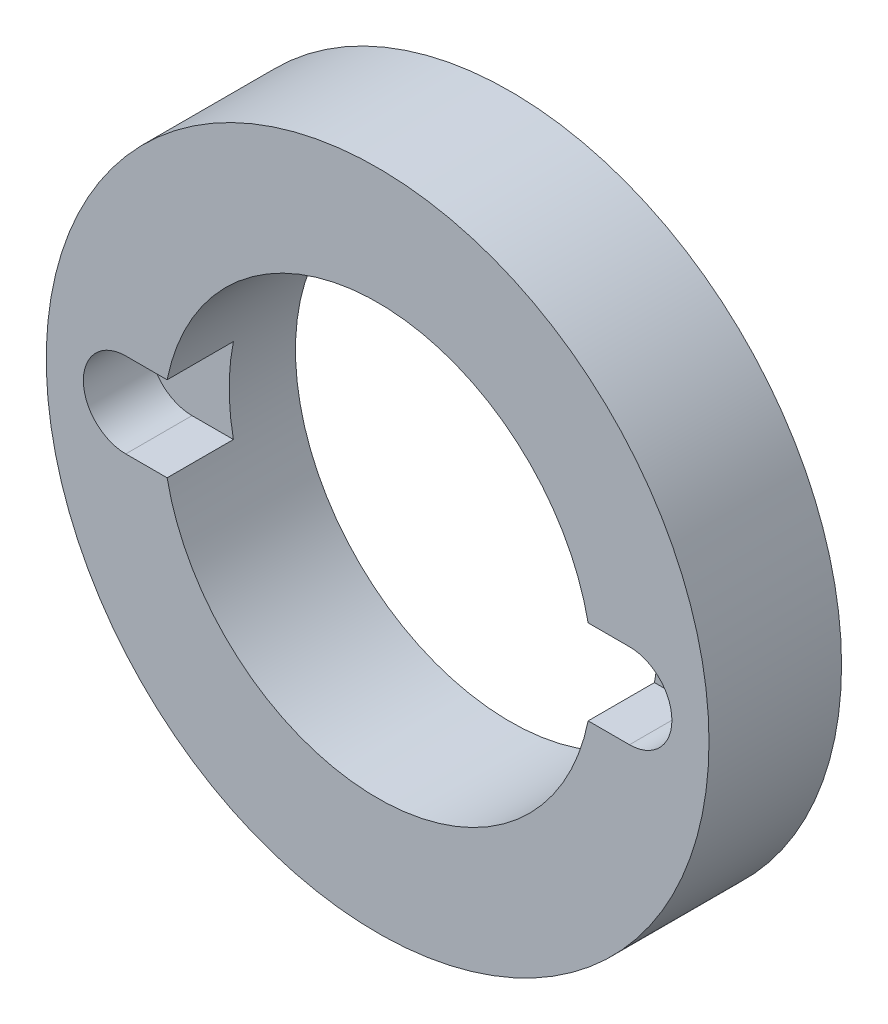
ISO-10303-21;
HEADER;
FILE_DESCRIPTION(('STEP AP214'),'2;1');
FILE_NAME('part.step','',(''),(''),'','','');
FILE_SCHEMA(('AUTOMOTIVE_DESIGN { 1 0 10303 214 1 1 1 1 }'));
ENDSEC;
DATA;
#1=APPLICATION_CONTEXT('core data for automotive mechanical design processes');
#2=APPLICATION_PROTOCOL_DEFINITION('international standard','automotive_design',2000,#1);
#3=PRODUCT_CONTEXT('',#1,'mechanical');
#4=PRODUCT('Part','Part','',(#3));
#5=PRODUCT_RELATED_PRODUCT_CATEGORY('part','',(#4));
#6=PRODUCT_DEFINITION_FORMATION('','',#4);
#7=PRODUCT_DEFINITION_CONTEXT('part definition',#1,'design');
#8=PRODUCT_DEFINITION('design','',#6,#7);
#9=PRODUCT_DEFINITION_SHAPE('','',#8);
#10=(LENGTH_UNIT() NAMED_UNIT(*) SI_UNIT(.MILLI.,.METRE.));
#11=(NAMED_UNIT(*) PLANE_ANGLE_UNIT() SI_UNIT($,.RADIAN.));
#12=(NAMED_UNIT(*) SI_UNIT($,.STERADIAN.) SOLID_ANGLE_UNIT());
#13=UNCERTAINTY_MEASURE_WITH_UNIT(LENGTH_MEASURE(1.E-05),#10,'distance_accuracy_value','');
#14=(GEOMETRIC_REPRESENTATION_CONTEXT(3) GLOBAL_UNCERTAINTY_ASSIGNED_CONTEXT((#13)) GLOBAL_UNIT_ASSIGNED_CONTEXT((#10,
#11,#12)) REPRESENTATION_CONTEXT('',''));
#15=CARTESIAN_POINT('',(0.,0.,0.));
#16=DIRECTION('',(0.,0.,1.));
#17=DIRECTION('',(1.,0.,0.));
#18=AXIS2_PLACEMENT_3D('',#15,#16,#17);
#19=CARTESIAN_POINT('',(0.,0.,5.));
#20=DIRECTION('',(0.,0.,-1.));
#21=DIRECTION('',(-1.,0.,0.));
#22=AXIS2_PLACEMENT_3D('',#19,#20,#21);
#23=CYLINDRICAL_SURFACE('',#22,12.5);
#24=CARTESIAN_POINT('',(0.,0.,5.));
#25=DIRECTION('',(0.,0.,1.));
#26=DIRECTION('',(1.,0.,0.));
#27=AXIS2_PLACEMENT_3D('',#24,#25,#26);
#28=CIRCLE('',#27,12.5);
#29=CARTESIAN_POINT('',(12.5,0.,5.));
#30=VERTEX_POINT('',#29);
#31=EDGE_CURVE('E156',#30,#30,#28,.T.);
#32=ORIENTED_EDGE('',*,*,#31,.F.);
#33=EDGE_LOOP('',(#32));
#34=FACE_BOUND('',#33,.T.);
#35=CARTESIAN_POINT('',(0.,0.,0.));
#36=DIRECTION('',(0.,0.,1.));
#37=DIRECTION('',(1.,0.,0.));
#38=AXIS2_PLACEMENT_3D('',#35,#36,#37);
#39=CIRCLE('',#38,12.5);
#40=CARTESIAN_POINT('',(12.5,0.,0.));
#41=VERTEX_POINT('',#40);
#42=EDGE_CURVE('E153',#41,#41,#39,.T.);
#43=ORIENTED_EDGE('',*,*,#42,.T.);
#44=EDGE_LOOP('',(#43));
#45=FACE_BOUND('',#44,.T.);
#46=ADVANCED_FACE('F36',(#34,#45),#23,.T.);
#47=CARTESIAN_POINT('',(0.,0.,5.));
#48=DIRECTION('',(0.,0.,1.));
#49=DIRECTION('',(1.,0.,0.));
#50=AXIS2_PLACEMENT_3D('',#47,#48,#49);
#51=PLANE('',#50);
#52=DIRECTION('',(-1.,0.,0.));
#53=VECTOR('',#52,1.);
#54=CARTESIAN_POINT('',(-9.50000000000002,1.6,5.));
#55=LINE('',#54,#53);
#56=CARTESIAN_POINT('',(-7.94040301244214,1.6,5.));
#57=VERTEX_POINT('',#56);
#58=CARTESIAN_POINT('',(-9.50000000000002,1.6,5.));
#59=VERTEX_POINT('',#58);
#60=EDGE_CURVE('E129',#57,#59,#55,.T.);
#61=ORIENTED_EDGE('',*,*,#60,.F.);
#62=CARTESIAN_POINT('',(0.,0.,5.));
#63=DIRECTION('',(0.,0.,1.));
#64=DIRECTION('',(1.,0.,0.));
#65=AXIS2_PLACEMENT_3D('',#62,#63,#64);
#66=CIRCLE('',#65,8.1);
#67=CARTESIAN_POINT('',(7.94040301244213,1.6,5.));
#68=VERTEX_POINT('',#67);
#69=EDGE_CURVE('E147',#68,#57,#66,.T.);
#70=ORIENTED_EDGE('',*,*,#69,.F.);
#71=CARTESIAN_POINT('',(9.50000000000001,1.6,5.));
#72=VERTEX_POINT('',#71);
#73=EDGE_CURVE('E132',#72,#68,#55,.T.);
#74=ORIENTED_EDGE('',*,*,#73,.F.);
#75=CARTESIAN_POINT('',(9.50000000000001,0.,5.));
#76=DIRECTION('',(0.,0.,1.));
#77=DIRECTION('',(1.,0.,0.));
#78=AXIS2_PLACEMENT_3D('',#75,#76,#77);
#79=CIRCLE('',#78,1.6);
#80=CARTESIAN_POINT('',(9.5,-1.6,5.));
#81=VERTEX_POINT('',#80);
#82=EDGE_CURVE('E126',#81,#72,#79,.T.);
#83=ORIENTED_EDGE('',*,*,#82,.F.);
#84=DIRECTION('',(1.,0.,0.));
#85=VECTOR('',#84,1.);
#86=CARTESIAN_POINT('',(9.5,-1.6,5.));
#87=LINE('',#86,#85);
#88=CARTESIAN_POINT('',(7.94040301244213,-1.60000000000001,5.));
#89=VERTEX_POINT('',#88);
#90=EDGE_CURVE('E118',#89,#81,#87,.T.);
#91=ORIENTED_EDGE('',*,*,#90,.F.);
#92=CARTESIAN_POINT('',(-7.94040301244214,-1.6,5.));
#93=VERTEX_POINT('',#92);
#94=EDGE_CURVE('E125',#93,#89,#66,.T.);
#95=ORIENTED_EDGE('',*,*,#94,.F.);
#96=CARTESIAN_POINT('',(-9.50000000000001,-1.6,5.));
#97=VERTEX_POINT('',#96);
#98=EDGE_CURVE('E104',#97,#93,#87,.T.);
#99=ORIENTED_EDGE('',*,*,#98,.F.);
#100=CARTESIAN_POINT('',(-9.50000000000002,0.,5.));
#101=DIRECTION('',(0.,0.,1.));
#102=DIRECTION('',(-1.,0.,0.));
#103=AXIS2_PLACEMENT_3D('',#100,#101,#102);
#104=CIRCLE('',#103,1.6);
#105=EDGE_CURVE('E112',#59,#97,#104,.T.);
#106=ORIENTED_EDGE('',*,*,#105,.F.);
#107=EDGE_LOOP('',(#61,#70,#74,#83,#91,#95,#99,#106));
#108=FACE_BOUND('',#107,.T.);
#109=ORIENTED_EDGE('',*,*,#31,.T.);
#110=EDGE_LOOP('',(#109));
#111=FACE_BOUND('',#110,.T.);
#112=ADVANCED_FACE('F121',(#108,#111),#51,.T.);
#113=CARTESIAN_POINT('',(0.,0.,0.));
#114=DIRECTION('',(0.,0.,1.));
#115=DIRECTION('',(1.,0.,0.));
#116=AXIS2_PLACEMENT_3D('',#113,#114,#115);
#117=PLANE('',#116);
#118=CARTESIAN_POINT('',(0.,0.,0.));
#119=DIRECTION('',(0.,0.,1.));
#120=DIRECTION('',(1.,0.,0.));
#121=AXIS2_PLACEMENT_3D('',#118,#119,#120);
#122=CIRCLE('',#121,8.1);
#123=CARTESIAN_POINT('',(8.10000000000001,0.,0.));
#124=VERTEX_POINT('',#123);
#125=EDGE_CURVE('E150',#124,#124,#122,.T.);
#126=ORIENTED_EDGE('',*,*,#125,.T.);
#127=EDGE_LOOP('',(#126));
#128=FACE_BOUND('',#127,.T.);
#129=ORIENTED_EDGE('',*,*,#42,.F.);
#130=EDGE_LOOP('',(#129));
#131=FACE_BOUND('',#130,.T.);
#132=ADVANCED_FACE('F196',(#128,#131),#117,.F.);
#133=CARTESIAN_POINT('',(0.,0.,0.));
#134=DIRECTION('',(0.,0.,1.));
#135=DIRECTION('',(1.,0.,0.));
#136=AXIS2_PLACEMENT_3D('',#133,#134,#135);
#137=CYLINDRICAL_SURFACE('',#136,8.1);
#138=CARTESIAN_POINT('',(0.,0.,2.5));
#139=DIRECTION('',(0.,0.,-1.));
#140=DIRECTION('',(-1.,0.,0.));
#141=AXIS2_PLACEMENT_3D('',#138,#139,#140);
#142=CIRCLE('',#141,8.1);
#143=CARTESIAN_POINT('',(7.94040301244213,-1.6,2.5));
#144=VERTEX_POINT('',#143);
#145=CARTESIAN_POINT('',(7.94040301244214,1.6,2.5));
#146=VERTEX_POINT('',#145);
#147=EDGE_CURVE('E163',#144,#146,#142,.F.);
#148=ORIENTED_EDGE('',*,*,#147,.T.);
#149=DIRECTION('',(0.,0.,1.));
#150=VECTOR('',#149,1.);
#151=CARTESIAN_POINT('',(7.94040301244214,1.6,0.));
#152=LINE('',#151,#150);
#153=EDGE_CURVE('E11',#146,#68,#152,.T.);
#154=ORIENTED_EDGE('',*,*,#153,.T.);
#155=ORIENTED_EDGE('',*,*,#69,.T.);
#156=DIRECTION('',(0.,0.,1.));
#157=VECTOR('',#156,1.);
#158=CARTESIAN_POINT('',(-7.94040301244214,1.60000000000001,0.));
#159=LINE('',#158,#157);
#160=CARTESIAN_POINT('',(-7.94040301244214,1.60000000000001,2.5));
#161=VERTEX_POINT('',#160);
#162=EDGE_CURVE('E165',#57,#161,#159,.F.);
#163=ORIENTED_EDGE('',*,*,#162,.T.);
#164=CARTESIAN_POINT('',(-7.94040301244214,-1.6,2.5));
#165=VERTEX_POINT('',#164);
#166=EDGE_CURVE('E159',#161,#165,#142,.F.);
#167=ORIENTED_EDGE('',*,*,#166,.T.);
#168=DIRECTION('',(0.,0.,1.));
#169=VECTOR('',#168,1.);
#170=CARTESIAN_POINT('',(-7.94040301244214,-1.6,0.));
#171=LINE('',#170,#169);
#172=EDGE_CURVE('E162',#165,#93,#171,.T.);
#173=ORIENTED_EDGE('',*,*,#172,.T.);
#174=ORIENTED_EDGE('',*,*,#94,.T.);
#175=DIRECTION('',(0.,0.,1.));
#176=VECTOR('',#175,1.);
#177=CARTESIAN_POINT('',(7.94040301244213,-1.6,0.));
#178=LINE('',#177,#176);
#179=EDGE_CURVE('E43',#89,#144,#178,.F.);
#180=ORIENTED_EDGE('',*,*,#179,.T.);
#181=EDGE_LOOP('',(#148,#154,#155,#163,#167,#173,#174,#180));
#182=FACE_BOUND('',#181,.T.);
#183=ORIENTED_EDGE('',*,*,#125,.F.);
#184=EDGE_LOOP('',(#183));
#185=FACE_BOUND('',#184,.T.);
#186=ADVANCED_FACE('F170',(#182,#185),#137,.F.);
#187=CARTESIAN_POINT('',(-9.5,0.,2.5));
#188=DIRECTION('',(0.,0.,-1.));
#189=DIRECTION('',(-1.,0.,0.));
#190=AXIS2_PLACEMENT_3D('',#187,#188,#189);
#191=PLANE('',#190);
#192=DIRECTION('',(-1.,0.,0.));
#193=VECTOR('',#192,1.);
#194=CARTESIAN_POINT('',(-9.50000000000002,1.6,2.5));
#195=LINE('',#194,#193);
#196=CARTESIAN_POINT('',(-9.50000000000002,1.6,2.5));
#197=VERTEX_POINT('',#196);
#198=EDGE_CURVE('E140',#161,#197,#195,.T.);
#199=ORIENTED_EDGE('',*,*,#198,.T.);
#200=CARTESIAN_POINT('',(-9.5,0.,2.5));
#201=DIRECTION('',(0.,0.,1.));
#202=DIRECTION('',(-1.,0.,0.));
#203=AXIS2_PLACEMENT_3D('',#200,#201,#202);
#204=CIRCLE('',#203,1.6);
#205=CARTESIAN_POINT('',(-9.50000000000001,-1.6,2.5));
#206=VERTEX_POINT('',#205);
#207=EDGE_CURVE('E134',#197,#206,#204,.T.);
#208=ORIENTED_EDGE('',*,*,#207,.T.);
#209=DIRECTION('',(1.,0.,0.));
#210=VECTOR('',#209,1.);
#211=CARTESIAN_POINT('',(9.50000000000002,-1.6,2.5));
#212=LINE('',#211,#210);
#213=EDGE_CURVE('E58',#206,#165,#212,.T.);
#214=ORIENTED_EDGE('',*,*,#213,.T.);
#215=ORIENTED_EDGE('',*,*,#166,.F.);
#216=EDGE_LOOP('',(#199,#208,#214,#215));
#217=FACE_BOUND('',#216,.T.);
#218=ADVANCED_FACE('F188',(#217),#191,.F.);
#219=CARTESIAN_POINT('',(9.50000000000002,-1.6,2.5));
#220=DIRECTION('',(0.,-1.,0.));
#221=DIRECTION('',(0.,0.,-1.));
#222=AXIS2_PLACEMENT_3D('',#219,#220,#221);
#223=PLANE('',#222);
#224=ORIENTED_EDGE('',*,*,#213,.F.);
#225=DIRECTION('',(0.,0.,1.));
#226=VECTOR('',#225,1.);
#227=CARTESIAN_POINT('',(-9.50000000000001,-1.6,2.5));
#228=LINE('',#227,#226);
#229=EDGE_CURVE('E100',#206,#97,#228,.T.);
#230=ORIENTED_EDGE('',*,*,#229,.T.);
#231=ORIENTED_EDGE('',*,*,#98,.T.);
#232=ORIENTED_EDGE('',*,*,#172,.F.);
#233=EDGE_LOOP('',(#224,#230,#231,#232));
#234=FACE_BOUND('',#233,.T.);
#235=ADVANCED_FACE('F102',(#234),#223,.F.);
#236=CARTESIAN_POINT('',(-9.50000000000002,1.6,2.5));
#237=DIRECTION('',(0.,1.,0.));
#238=DIRECTION('',(0.,0.,1.));
#239=AXIS2_PLACEMENT_3D('',#236,#237,#238);
#240=PLANE('',#239);
#241=ORIENTED_EDGE('',*,*,#60,.T.);
#242=DIRECTION('',(0.,0.,1.));
#243=VECTOR('',#242,1.);
#244=CARTESIAN_POINT('',(-9.50000000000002,1.6,2.5));
#245=LINE('',#244,#243);
#246=EDGE_CURVE('E115',#197,#59,#245,.T.);
#247=ORIENTED_EDGE('',*,*,#246,.F.);
#248=ORIENTED_EDGE('',*,*,#198,.F.);
#249=ORIENTED_EDGE('',*,*,#162,.F.);
#250=EDGE_LOOP('',(#241,#247,#248,#249));
#251=FACE_BOUND('',#250,.T.);
#252=ADVANCED_FACE('F187',(#251),#240,.F.);
#253=CARTESIAN_POINT('',(-9.5,0.,2.5));
#254=DIRECTION('',(0.,0.,1.));
#255=DIRECTION('',(1.,0.,0.));
#256=AXIS2_PLACEMENT_3D('',#253,#254,#255);
#257=CYLINDRICAL_SURFACE('',#256,1.6);
#258=ORIENTED_EDGE('',*,*,#105,.T.);
#259=ORIENTED_EDGE('',*,*,#229,.F.);
#260=ORIENTED_EDGE('',*,*,#207,.F.);
#261=ORIENTED_EDGE('',*,*,#246,.T.);
#262=EDGE_LOOP('',(#258,#259,#260,#261));
#263=FACE_BOUND('',#262,.T.);
#264=ADVANCED_FACE('F113',(#263),#257,.F.);
#265=CARTESIAN_POINT('',(9.50000000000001,1.6,2.5));
#266=VERTEX_POINT('',#265);
#267=EDGE_CURVE('E50',#266,#146,#195,.T.);
#268=ORIENTED_EDGE('',*,*,#267,.F.);
#269=DIRECTION('',(0.,0.,1.));
#270=VECTOR('',#269,1.);
#271=CARTESIAN_POINT('',(9.50000000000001,1.6,2.5));
#272=LINE('',#271,#270);
#273=EDGE_CURVE('E143',#266,#72,#272,.T.);
#274=ORIENTED_EDGE('',*,*,#273,.T.);
#275=ORIENTED_EDGE('',*,*,#73,.T.);
#276=ORIENTED_EDGE('',*,*,#153,.F.);
#277=EDGE_LOOP('',(#268,#274,#275,#276));
#278=FACE_BOUND('',#277,.T.);
#279=ADVANCED_FACE('F183',(#278),#240,.F.);
#280=ORIENTED_EDGE('',*,*,#90,.T.);
#281=DIRECTION('',(0.,0.,1.));
#282=VECTOR('',#281,1.);
#283=CARTESIAN_POINT('',(9.50000000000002,-1.6,2.5));
#284=LINE('',#283,#282);
#285=CARTESIAN_POINT('',(9.50000000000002,-1.6,2.5));
#286=VERTEX_POINT('',#285);
#287=EDGE_CURVE('E108',#286,#81,#284,.T.);
#288=ORIENTED_EDGE('',*,*,#287,.F.);
#289=EDGE_CURVE('E136',#144,#286,#212,.T.);
#290=ORIENTED_EDGE('',*,*,#289,.F.);
#291=ORIENTED_EDGE('',*,*,#179,.F.);
#292=EDGE_LOOP('',(#280,#288,#290,#291));
#293=FACE_BOUND('',#292,.T.);
#294=ADVANCED_FACE('F177',(#293),#223,.F.);
#295=ORIENTED_EDGE('',*,*,#289,.T.);
#296=CARTESIAN_POINT('',(9.50000000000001,0.,2.5));
#297=DIRECTION('',(0.,0.,1.));
#298=DIRECTION('',(1.,0.,0.));
#299=AXIS2_PLACEMENT_3D('',#296,#297,#298);
#300=CIRCLE('',#299,1.6);
#301=EDGE_CURVE('E138',#286,#266,#300,.T.);
#302=ORIENTED_EDGE('',*,*,#301,.T.);
#303=ORIENTED_EDGE('',*,*,#267,.T.);
#304=ORIENTED_EDGE('',*,*,#147,.F.);
#305=EDGE_LOOP('',(#295,#302,#303,#304));
#306=FACE_BOUND('',#305,.T.);
#307=ADVANCED_FACE('F174',(#306),#191,.F.);
#308=CARTESIAN_POINT('',(9.50000000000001,0.,2.5));
#309=DIRECTION('',(0.,0.,1.));
#310=DIRECTION('',(1.,0.,0.));
#311=AXIS2_PLACEMENT_3D('',#308,#309,#310);
#312=CYLINDRICAL_SURFACE('',#311,1.6);
#313=ORIENTED_EDGE('',*,*,#82,.T.);
#314=ORIENTED_EDGE('',*,*,#273,.F.);
#315=ORIENTED_EDGE('',*,*,#301,.F.);
#316=ORIENTED_EDGE('',*,*,#287,.T.);
#317=EDGE_LOOP('',(#313,#314,#315,#316));
#318=FACE_BOUND('',#317,.T.);
#319=ADVANCED_FACE('F181',(#318),#312,.F.);
#320=CLOSED_SHELL('',(#46,#112,#132,#186,#218,#235,#252,#264,#279,#294,#307,#319));
#321=MANIFOLD_SOLID_BREP('B2',#320);
#322=ADVANCED_BREP_SHAPE_REPRESENTATION('',(#18,#321),#14);
#323=SHAPE_DEFINITION_REPRESENTATION(#9,#322);
ENDSEC;
END-ISO-10303-21;
